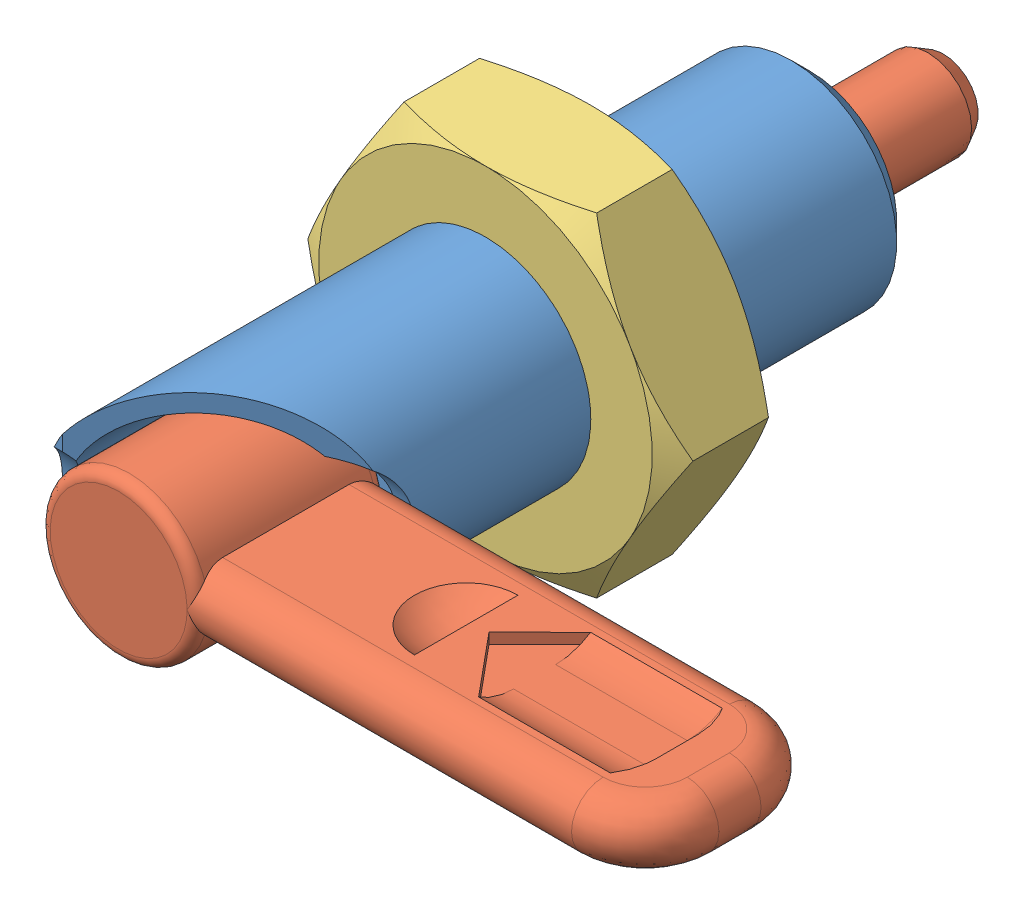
SolidWorks assembly GDX12LW-5N-SUS.sldasm, configuration Default (file format 15000). Lengths in mm.
Overall size (42.98 25.96 47.41).
3 component instances, 3 part files, 0 mates.
Components (placement in the parent):
- GDX12LW-5N-SUS_01-1: GDX12LW-5N-SUS_01.SLDPRT [ﾃﾞﾌｫﾙﾄ] x (1 0 0) z (0 -1 0) size (12.02 39.35 12.01)
- GDX12LW-5N-SUS_02-1: GDX12LW-5N-SUS_02.SLDPRT [ﾃﾞﾌｫﾙﾄ] x (1 0 0) z (0 -1 0) size (34.5 47.41 9)
- GDX12LW-5N-SUS_03-1: GDX12LW-5N-SUS_03.SLDPRT [ﾃﾞﾌｫﾙﾄ] at (0 0 12.5) x (0 0 1) z (0 1 0) size (6.01 25.96 25.96)
